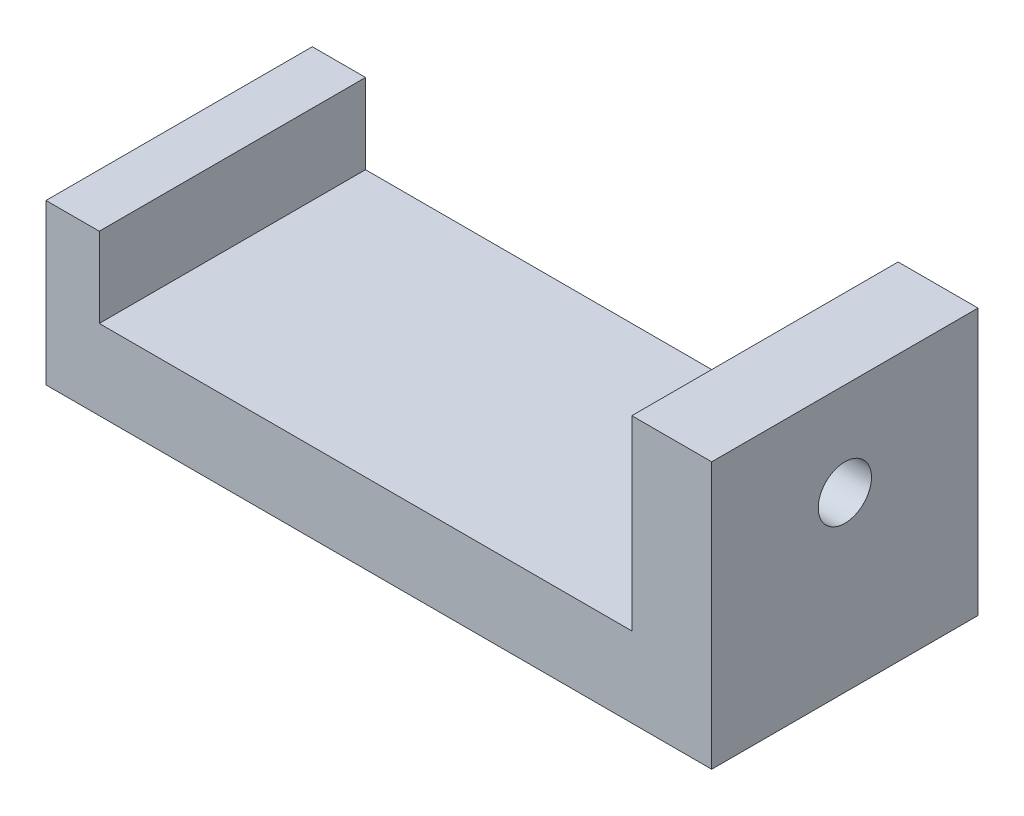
ISO-10303-21;
HEADER;
FILE_DESCRIPTION(('STEP AP214'),'2;1');
FILE_NAME('part.step','',(''),(''),'','','');
FILE_SCHEMA(('AUTOMOTIVE_DESIGN { 1 0 10303 214 1 1 1 1 }'));
ENDSEC;
DATA;
#1=APPLICATION_CONTEXT('core data for automotive mechanical design processes');
#2=APPLICATION_PROTOCOL_DEFINITION('international standard','automotive_design',2000,#1);
#3=PRODUCT_CONTEXT('',#1,'mechanical');
#4=PRODUCT('Part','Part','',(#3));
#5=PRODUCT_RELATED_PRODUCT_CATEGORY('part','',(#4));
#6=PRODUCT_DEFINITION_FORMATION('','',#4);
#7=PRODUCT_DEFINITION_CONTEXT('part definition',#1,'design');
#8=PRODUCT_DEFINITION('design','',#6,#7);
#9=PRODUCT_DEFINITION_SHAPE('','',#8);
#10=(LENGTH_UNIT() NAMED_UNIT(*) SI_UNIT(.MILLI.,.METRE.));
#11=(NAMED_UNIT(*) PLANE_ANGLE_UNIT() SI_UNIT($,.RADIAN.));
#12=(NAMED_UNIT(*) SI_UNIT($,.STERADIAN.) SOLID_ANGLE_UNIT());
#13=UNCERTAINTY_MEASURE_WITH_UNIT(LENGTH_MEASURE(1.E-05),#10,'distance_accuracy_value','');
#14=(GEOMETRIC_REPRESENTATION_CONTEXT(3) GLOBAL_UNCERTAINTY_ASSIGNED_CONTEXT((#13)) GLOBAL_UNIT_ASSIGNED_CONTEXT((#10,
#11,#12)) REPRESENTATION_CONTEXT('',''));
#15=CARTESIAN_POINT('',(0.,0.,0.));
#16=DIRECTION('',(0.,0.,1.));
#17=DIRECTION('',(1.,0.,0.));
#18=AXIS2_PLACEMENT_3D('',#15,#16,#17);
#19=CARTESIAN_POINT('',(0.,0.,50.));
#20=DIRECTION('',(0.,1.,0.));
#21=DIRECTION('',(0.,0.,1.));
#22=AXIS2_PLACEMENT_3D('',#19,#20,#21);
#23=PLANE('',#22);
#24=DIRECTION('',(1.,0.,0.));
#25=VECTOR('',#24,1.);
#26=CARTESIAN_POINT('',(0.,0.,0.));
#27=LINE('',#26,#25);
#28=CARTESIAN_POINT('',(0.,0.,0.));
#29=VERTEX_POINT('',#28);
#30=CARTESIAN_POINT('',(125.,0.,0.));
#31=VERTEX_POINT('',#30);
#32=EDGE_CURVE('E129',#29,#31,#27,.T.);
#33=ORIENTED_EDGE('',*,*,#32,.T.);
#34=DIRECTION('',(0.,0.,-1.));
#35=VECTOR('',#34,1.);
#36=CARTESIAN_POINT('',(125.,0.,50.));
#37=LINE('',#36,#35);
#38=CARTESIAN_POINT('',(125.,0.,50.));
#39=VERTEX_POINT('',#38);
#40=EDGE_CURVE('E11',#39,#31,#37,.T.);
#41=ORIENTED_EDGE('',*,*,#40,.F.);
#42=DIRECTION('',(1.,0.,0.));
#43=VECTOR('',#42,1.);
#44=CARTESIAN_POINT('',(0.,0.,50.));
#45=LINE('',#44,#43);
#46=CARTESIAN_POINT('',(0.,0.,50.));
#47=VERTEX_POINT('',#46);
#48=EDGE_CURVE('E143',#47,#39,#45,.T.);
#49=ORIENTED_EDGE('',*,*,#48,.F.);
#50=DIRECTION('',(0.,0.,-1.));
#51=VECTOR('',#50,1.);
#52=CARTESIAN_POINT('',(0.,0.,50.));
#53=LINE('',#52,#51);
#54=EDGE_CURVE('E125',#47,#29,#53,.T.);
#55=ORIENTED_EDGE('',*,*,#54,.T.);
#56=EDGE_LOOP('',(#33,#41,#49,#55));
#57=FACE_BOUND('',#56,.T.);
#58=ADVANCED_FACE('F32',(#57),#23,.F.);
#59=CARTESIAN_POINT('',(125.,0.,50.));
#60=DIRECTION('',(-1.,0.,0.));
#61=DIRECTION('',(0.,0.,1.));
#62=AXIS2_PLACEMENT_3D('',#59,#60,#61);
#63=PLANE('',#62);
#64=CARTESIAN_POINT('',(125.,32.5,25.));
#65=DIRECTION('',(1.,0.,0.));
#66=DIRECTION('',(0.,0.,-1.));
#67=AXIS2_PLACEMENT_3D('',#64,#65,#66);
#68=CIRCLE('',#67,5.);
#69=CARTESIAN_POINT('',(125.,32.5,20.));
#70=VERTEX_POINT('',#69);
#71=EDGE_CURVE('E177',#70,#70,#68,.T.);
#72=ORIENTED_EDGE('',*,*,#71,.F.);
#73=EDGE_LOOP('',(#72));
#74=FACE_BOUND('',#73,.T.);
#75=DIRECTION('',(0.,1.,0.));
#76=VECTOR('',#75,1.);
#77=CARTESIAN_POINT('',(125.,0.,0.));
#78=LINE('',#77,#76);
#79=CARTESIAN_POINT('',(125.,50.,0.));
#80=VERTEX_POINT('',#79);
#81=EDGE_CURVE('E132',#31,#80,#78,.T.);
#82=ORIENTED_EDGE('',*,*,#81,.T.);
#83=DIRECTION('',(0.,0.,-1.));
#84=VECTOR('',#83,1.);
#85=CARTESIAN_POINT('',(125.,50.,50.));
#86=LINE('',#85,#84);
#87=CARTESIAN_POINT('',(125.,50.,50.));
#88=VERTEX_POINT('',#87);
#89=EDGE_CURVE('E41',#88,#80,#86,.T.);
#90=ORIENTED_EDGE('',*,*,#89,.F.);
#91=DIRECTION('',(0.,1.,0.));
#92=VECTOR('',#91,1.);
#93=CARTESIAN_POINT('',(125.,0.,50.));
#94=LINE('',#93,#92);
#95=EDGE_CURVE('E92',#39,#88,#94,.T.);
#96=ORIENTED_EDGE('',*,*,#95,.F.);
#97=ORIENTED_EDGE('',*,*,#40,.T.);
#98=EDGE_LOOP('',(#82,#90,#96,#97));
#99=FACE_BOUND('',#98,.T.);
#100=ADVANCED_FACE('F194',(#74,#99),#63,.F.);
#101=CARTESIAN_POINT('',(125.,50.,50.));
#102=DIRECTION('',(0.,-1.,0.));
#103=DIRECTION('',(0.,0.,-1.));
#104=AXIS2_PLACEMENT_3D('',#101,#102,#103);
#105=PLANE('',#104);
#106=DIRECTION('',(-1.,0.,0.));
#107=VECTOR('',#106,1.);
#108=CARTESIAN_POINT('',(125.,50.,0.));
#109=LINE('',#108,#107);
#110=CARTESIAN_POINT('',(110.,50.,0.));
#111=VERTEX_POINT('',#110);
#112=EDGE_CURVE('E134',#80,#111,#109,.T.);
#113=ORIENTED_EDGE('',*,*,#112,.T.);
#114=DIRECTION('',(0.,0.,-1.));
#115=VECTOR('',#114,1.);
#116=CARTESIAN_POINT('',(110.,50.,50.));
#117=LINE('',#116,#115);
#118=CARTESIAN_POINT('',(110.,50.,50.));
#119=VERTEX_POINT('',#118);
#120=EDGE_CURVE('E150',#119,#111,#117,.T.);
#121=ORIENTED_EDGE('',*,*,#120,.F.);
#122=DIRECTION('',(-1.,0.,0.));
#123=VECTOR('',#122,1.);
#124=CARTESIAN_POINT('',(125.,50.,50.));
#125=LINE('',#124,#123);
#126=EDGE_CURVE('E159',#88,#119,#125,.T.);
#127=ORIENTED_EDGE('',*,*,#126,.F.);
#128=ORIENTED_EDGE('',*,*,#89,.T.);
#129=EDGE_LOOP('',(#113,#121,#127,#128));
#130=FACE_BOUND('',#129,.T.);
#131=ADVANCED_FACE('F157',(#130),#105,.F.);
#132=CARTESIAN_POINT('',(110.,50.,50.));
#133=DIRECTION('',(1.,0.,0.));
#134=DIRECTION('',(0.,1.,0.));
#135=AXIS2_PLACEMENT_3D('',#132,#133,#134);
#136=PLANE('',#135);
#137=CARTESIAN_POINT('',(110.,32.5,25.));
#138=DIRECTION('',(1.,0.,0.));
#139=DIRECTION('',(0.,1.,0.));
#140=AXIS2_PLACEMENT_3D('',#137,#138,#139);
#141=CIRCLE('',#140,4.99999999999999);
#142=CARTESIAN_POINT('',(110.,37.5,25.));
#143=VERTEX_POINT('',#142);
#144=EDGE_CURVE('E35',#143,#143,#141,.T.);
#145=ORIENTED_EDGE('',*,*,#144,.T.);
#146=EDGE_LOOP('',(#145));
#147=FACE_BOUND('',#146,.T.);
#148=DIRECTION('',(0.,-1.,0.));
#149=VECTOR('',#148,1.);
#150=CARTESIAN_POINT('',(110.,50.,0.));
#151=LINE('',#150,#149);
#152=CARTESIAN_POINT('',(110.,15.,0.));
#153=VERTEX_POINT('',#152);
#154=EDGE_CURVE('E136',#111,#153,#151,.T.);
#155=ORIENTED_EDGE('',*,*,#154,.T.);
#156=DIRECTION('',(0.,0.,-1.));
#157=VECTOR('',#156,1.);
#158=CARTESIAN_POINT('',(110.,15.,50.));
#159=LINE('',#158,#157);
#160=CARTESIAN_POINT('',(110.,15.,50.));
#161=VERTEX_POINT('',#160);
#162=EDGE_CURVE('E147',#161,#153,#159,.T.);
#163=ORIENTED_EDGE('',*,*,#162,.F.);
#164=DIRECTION('',(0.,-1.,0.));
#165=VECTOR('',#164,1.);
#166=CARTESIAN_POINT('',(110.,50.,50.));
#167=LINE('',#166,#165);
#168=EDGE_CURVE('E171',#119,#161,#167,.T.);
#169=ORIENTED_EDGE('',*,*,#168,.F.);
#170=ORIENTED_EDGE('',*,*,#120,.T.);
#171=EDGE_LOOP('',(#155,#163,#169,#170));
#172=FACE_BOUND('',#171,.T.);
#173=ADVANCED_FACE('F167',(#147,#172),#136,.F.);
#174=CARTESIAN_POINT('',(110.,15.,50.));
#175=DIRECTION('',(0.,-1.,0.));
#176=DIRECTION('',(1.,0.,0.));
#177=AXIS2_PLACEMENT_3D('',#174,#175,#176);
#178=PLANE('',#177);
#179=DIRECTION('',(-1.,0.,0.));
#180=VECTOR('',#179,1.);
#181=CARTESIAN_POINT('',(110.,15.,0.));
#182=LINE('',#181,#180);
#183=CARTESIAN_POINT('',(10.,15.,0.));
#184=VERTEX_POINT('',#183);
#185=EDGE_CURVE('E138',#153,#184,#182,.T.);
#186=ORIENTED_EDGE('',*,*,#185,.T.);
#187=DIRECTION('',(0.,0.,-1.));
#188=VECTOR('',#187,1.);
#189=CARTESIAN_POINT('',(10.,15.,50.));
#190=LINE('',#189,#188);
#191=CARTESIAN_POINT('',(10.,15.,50.));
#192=VERTEX_POINT('',#191);
#193=EDGE_CURVE('E120',#192,#184,#190,.T.);
#194=ORIENTED_EDGE('',*,*,#193,.F.);
#195=DIRECTION('',(-1.,0.,0.));
#196=VECTOR('',#195,1.);
#197=CARTESIAN_POINT('',(110.,15.,50.));
#198=LINE('',#197,#196);
#199=EDGE_CURVE('E111',#161,#192,#198,.T.);
#200=ORIENTED_EDGE('',*,*,#199,.F.);
#201=ORIENTED_EDGE('',*,*,#162,.T.);
#202=EDGE_LOOP('',(#186,#194,#200,#201));
#203=FACE_BOUND('',#202,.T.);
#204=ADVANCED_FACE('F170',(#203),#178,.F.);
#205=CARTESIAN_POINT('',(10.,15.,50.));
#206=DIRECTION('',(-1.,0.,0.));
#207=DIRECTION('',(0.,-1.,0.));
#208=AXIS2_PLACEMENT_3D('',#205,#206,#207);
#209=PLANE('',#208);
#210=DIRECTION('',(0.,1.,0.));
#211=VECTOR('',#210,1.);
#212=CARTESIAN_POINT('',(10.,15.,0.));
#213=LINE('',#212,#211);
#214=CARTESIAN_POINT('',(10.,30.,0.));
#215=VERTEX_POINT('',#214);
#216=EDGE_CURVE('E119',#184,#215,#213,.T.);
#217=ORIENTED_EDGE('',*,*,#216,.T.);
#218=DIRECTION('',(0.,0.,-1.));
#219=VECTOR('',#218,1.);
#220=CARTESIAN_POINT('',(10.,30.,50.));
#221=LINE('',#220,#219);
#222=CARTESIAN_POINT('',(10.,30.,50.));
#223=VERTEX_POINT('',#222);
#224=EDGE_CURVE('E116',#223,#215,#221,.T.);
#225=ORIENTED_EDGE('',*,*,#224,.F.);
#226=DIRECTION('',(0.,1.,0.));
#227=VECTOR('',#226,1.);
#228=CARTESIAN_POINT('',(10.,15.,50.));
#229=LINE('',#228,#227);
#230=EDGE_CURVE('E105',#192,#223,#229,.T.);
#231=ORIENTED_EDGE('',*,*,#230,.F.);
#232=ORIENTED_EDGE('',*,*,#193,.T.);
#233=EDGE_LOOP('',(#217,#225,#231,#232));
#234=FACE_BOUND('',#233,.T.);
#235=ADVANCED_FACE('F117',(#234),#209,.F.);
#236=CARTESIAN_POINT('',(10.,30.,50.));
#237=DIRECTION('',(0.,-1.,0.));
#238=DIRECTION('',(0.,0.,-1.));
#239=AXIS2_PLACEMENT_3D('',#236,#237,#238);
#240=PLANE('',#239);
#241=DIRECTION('',(-1.,0.,0.));
#242=VECTOR('',#241,1.);
#243=CARTESIAN_POINT('',(10.,30.,0.));
#244=LINE('',#243,#242);
#245=CARTESIAN_POINT('',(0.,30.,0.));
#246=VERTEX_POINT('',#245);
#247=EDGE_CURVE('E78',#215,#246,#244,.T.);
#248=ORIENTED_EDGE('',*,*,#247,.T.);
#249=DIRECTION('',(0.,0.,-1.));
#250=VECTOR('',#249,1.);
#251=CARTESIAN_POINT('',(0.,30.,50.));
#252=LINE('',#251,#250);
#253=CARTESIAN_POINT('',(0.,30.,50.));
#254=VERTEX_POINT('',#253);
#255=EDGE_CURVE('E121',#254,#246,#252,.T.);
#256=ORIENTED_EDGE('',*,*,#255,.F.);
#257=DIRECTION('',(-1.,0.,0.));
#258=VECTOR('',#257,1.);
#259=CARTESIAN_POINT('',(10.,30.,50.));
#260=LINE('',#259,#258);
#261=EDGE_CURVE('E109',#223,#254,#260,.T.);
#262=ORIENTED_EDGE('',*,*,#261,.F.);
#263=ORIENTED_EDGE('',*,*,#224,.T.);
#264=EDGE_LOOP('',(#248,#256,#262,#263));
#265=FACE_BOUND('',#264,.T.);
#266=ADVANCED_FACE('F123',(#265),#240,.F.);
#267=CARTESIAN_POINT('',(0.,30.,50.));
#268=DIRECTION('',(1.,0.,0.));
#269=DIRECTION('',(0.,1.,0.));
#270=AXIS2_PLACEMENT_3D('',#267,#268,#269);
#271=PLANE('',#270);
#272=DIRECTION('',(0.,-1.,0.));
#273=VECTOR('',#272,1.);
#274=CARTESIAN_POINT('',(0.,30.,0.));
#275=LINE('',#274,#273);
#276=EDGE_CURVE('E84',#246,#29,#275,.T.);
#277=ORIENTED_EDGE('',*,*,#276,.T.);
#278=ORIENTED_EDGE('',*,*,#54,.F.);
#279=DIRECTION('',(0.,-1.,0.));
#280=VECTOR('',#279,1.);
#281=CARTESIAN_POINT('',(0.,30.,50.));
#282=LINE('',#281,#280);
#283=EDGE_CURVE('E49',#254,#47,#282,.T.);
#284=ORIENTED_EDGE('',*,*,#283,.F.);
#285=ORIENTED_EDGE('',*,*,#255,.T.);
#286=EDGE_LOOP('',(#277,#278,#284,#285));
#287=FACE_BOUND('',#286,.T.);
#288=ADVANCED_FACE('F202',(#287),#271,.F.);
#289=CARTESIAN_POINT('',(125.,0.,50.));
#290=DIRECTION('',(0.,0.,1.));
#291=DIRECTION('',(1.,0.,0.));
#292=AXIS2_PLACEMENT_3D('',#289,#290,#291);
#293=PLANE('',#292);
#294=ORIENTED_EDGE('',*,*,#48,.T.);
#295=ORIENTED_EDGE('',*,*,#95,.T.);
#296=ORIENTED_EDGE('',*,*,#126,.T.);
#297=ORIENTED_EDGE('',*,*,#168,.T.);
#298=ORIENTED_EDGE('',*,*,#199,.T.);
#299=ORIENTED_EDGE('',*,*,#230,.T.);
#300=ORIENTED_EDGE('',*,*,#261,.T.);
#301=ORIENTED_EDGE('',*,*,#283,.T.);
#302=EDGE_LOOP('',(#294,#295,#296,#297,#298,#299,#300,#301));
#303=FACE_BOUND('',#302,.T.);
#304=ADVANCED_FACE('F107',(#303),#293,.T.);
#305=CARTESIAN_POINT('',(125.,0.,0.));
#306=DIRECTION('',(0.,0.,1.));
#307=DIRECTION('',(1.,0.,0.));
#308=AXIS2_PLACEMENT_3D('',#305,#306,#307);
#309=PLANE('',#308);
#310=ORIENTED_EDGE('',*,*,#32,.F.);
#311=ORIENTED_EDGE('',*,*,#276,.F.);
#312=ORIENTED_EDGE('',*,*,#247,.F.);
#313=ORIENTED_EDGE('',*,*,#216,.F.);
#314=ORIENTED_EDGE('',*,*,#185,.F.);
#315=ORIENTED_EDGE('',*,*,#154,.F.);
#316=ORIENTED_EDGE('',*,*,#112,.F.);
#317=ORIENTED_EDGE('',*,*,#81,.F.);
#318=EDGE_LOOP('',(#310,#311,#312,#313,#314,#315,#316,#317));
#319=FACE_BOUND('',#318,.T.);
#320=ADVANCED_FACE('F163',(#319),#309,.F.);
#321=CARTESIAN_POINT('',(125.,32.5,25.));
#322=DIRECTION('',(1.,0.,0.));
#323=DIRECTION('',(0.,0.,-1.));
#324=AXIS2_PLACEMENT_3D('',#321,#322,#323);
#325=CYLINDRICAL_SURFACE('',#324,4.99999999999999);
#326=ORIENTED_EDGE('',*,*,#71,.T.);
#327=EDGE_LOOP('',(#326));
#328=FACE_BOUND('',#327,.T.);
#329=ORIENTED_EDGE('',*,*,#144,.F.);
#330=EDGE_LOOP('',(#329));
#331=FACE_BOUND('',#330,.T.);
#332=ADVANCED_FACE('F185',(#328,#331),#325,.F.);
#333=CLOSED_SHELL('',(#58,#100,#131,#173,#204,#235,#266,#288,#304,#320,#332));
#334=MANIFOLD_SOLID_BREP('B2',#333);
#335=ADVANCED_BREP_SHAPE_REPRESENTATION('',(#18,#334),#14);
#336=SHAPE_DEFINITION_REPRESENTATION(#9,#335);
ENDSEC;
END-ISO-10303-21;
